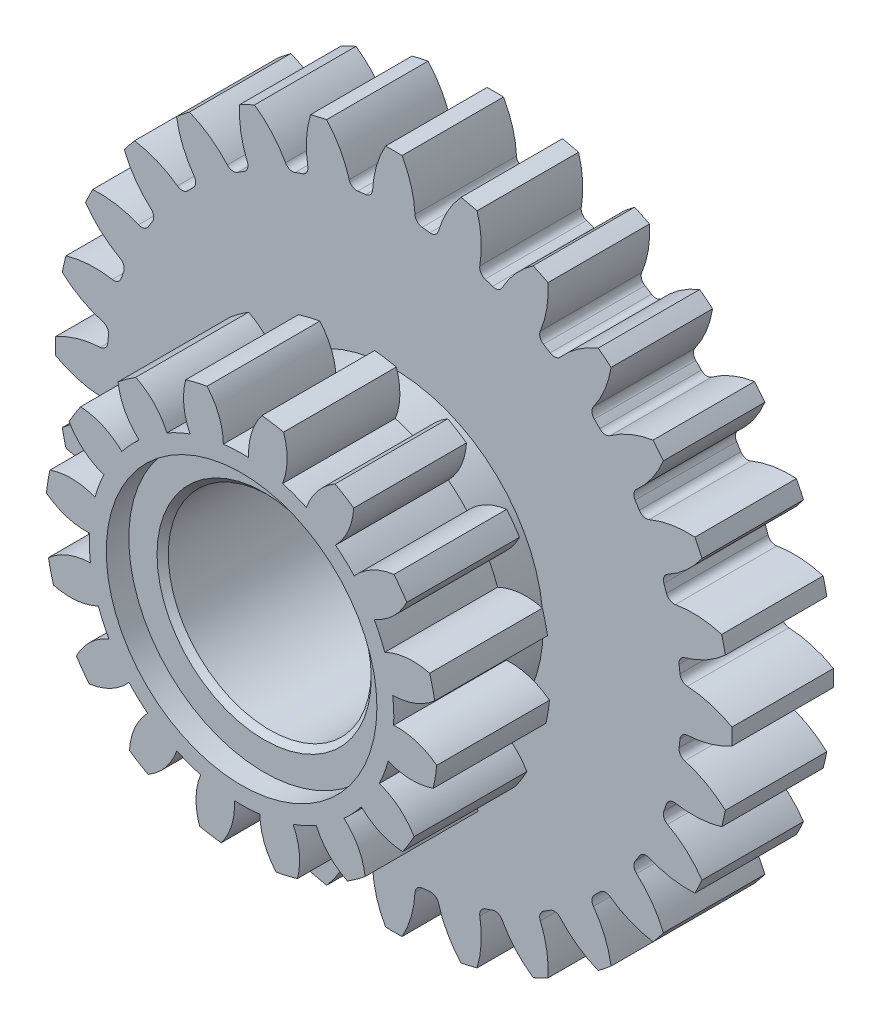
from build123d import *

# Parameters (mm, degrees)
ESQUISSE1_R                        = 5
BASE_EXTRUSION_DEPTH               = 2
BOSS_EXTRU_1_DEPTH                 = 9
CONG_1_R                           = 0.7
R_P_TITION_CIRCULAIRE4_COUNT       = 28
CONG_1_OF_R_P_TITION_CIRCULAIRE4_R = 0.7
ESQUISSE10_R                       = 13.25
BOSS_EXTRU_2_DEPTH                 = 3.5
ENL_V_MAT_EXTRU_2_DEPTH            = 44.829214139
ENL_V_MAT_EXTRU_2_DEPTH_BACK       = 44.829214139
ESQUISSE6_R                        = 9
BOSS_EXTRU_3_DEPTH                 = 10
R_P_TITION_CIRCULAIRE5_COUNT       = 16
ESQUISSE14_R                       = 9
ENL_V_MAT_EXTRU_3_DEPTH            = 45.229515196
ESQUISSE15_R                       = 12
LAMAGE_DEPTH                       = 2
CHANFREIN1_SIZE                    = 0.5
ESQUISSE16_W                       = 7
ESQUISSE16_H                       = 10.5
CHANFREIN2_SIZE                    = 1


with BuildPart() as part:
    # Esquisse1 → Base-Extrusion (new body)
    with BuildSketch(Plane.XY):
        Circle(ESQUISSE1_R)
    extrude(amount=BASE_EXTRUSION_DEPTH)

    # Esquisse3 → Boss.-Extru.1 (add)
    with BuildSketch(Plane.XY.offset(2)):
        with BuildLine():
            Line((-2.855094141, 25.339661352), (0, 0))
            Line((0, 0), (2.855094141, 25.339661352))
            ThreePointArc((2.855094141, 25.339661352), (2.373403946, 25.389307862), (1.890857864, 25.429798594))
            ThreePointArc((1.890857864, 25.429798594), (1.614508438, 27.78765047), (0.730952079, 29.991093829))
            ThreePointArc((0.730952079, 29.991093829), (0, 30), (-0.730952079, 29.991093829))
            ThreePointArc((-0.730952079, 29.991093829), (-1.614508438, 27.78765047), (-1.890857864, 25.429798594))
            ThreePointArc((-1.890857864, 25.429798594), (-2.373403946, 25.389307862), (-2.855094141, 25.339661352))
        make_face()
    boss_extru_1 = extrude(amount=BOSS_EXTRU_1_DEPTH)

    # Cong_1
    cong_1_edges = [part.edges().sort_by_distance(p)[0] for p in [
        (1.890857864, 25.429798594, 6.5),
        (-1.890857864, 25.429798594, 6.5),
    ]]
    fillet(cong_1_edges, radius=CONG_1_R)

    # R_p_tition circulaire4: Boss.-Extru.1 ×28 about axis
    r_p_tition_circulaire4_axis = Axis((0, 0, 0), (0, 0, 1))
    for i in range(1, R_P_TITION_CIRCULAIRE4_COUNT):
        add(boss_extru_1.rotate(r_p_tition_circulaire4_axis, i * 360 / R_P_TITION_CIRCULAIRE4_COUNT))

    # Cong_1 of R_p_tition circulaire4
    cong_1_of_r_p_tition_circulaire4_edges = [part.edges().sort_by_distance(p)[0] for p in [
        (-3.815212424, 25.212975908, 6.5),
        (-7.502112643, 24.371464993, 6.5),
        (-9.32997203, 23.731869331, 6.5),
        (-12.737180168, 22.09104437, 6.5),
        (-14.37688788, 21.060747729, 6.5),
        (-17.333552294, 18.702886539, 6.5),
        (-18.702886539, 17.333552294, 6.5),
        (-21.060747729, 14.37688788, 6.5),
        (-22.09104437, 12.737180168, 6.5),
        (-23.731869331, 9.32997203, 6.5),
        (-24.371464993, 7.502112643, 6.5),
        (-25.212975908, 3.815212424, 6.5),
        (-25.429798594, 1.890857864, 6.5),
        (-25.429798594, -1.890857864, 6.5),
        (-25.212975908, -3.815212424, 6.5),
        (-24.371464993, -7.502112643, 6.5),
        (-23.731869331, -9.32997203, 6.5),
        (-22.09104437, -12.737180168, 6.5),
        (-21.060747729, -14.37688788, 6.5),
        (-18.702886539, -17.333552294, 6.5),
        (-17.333552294, -18.702886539, 6.5),
        (-14.37688788, -21.060747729, 6.5),
        (-12.737180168, -22.09104437, 6.5),
        (-9.32997203, -23.731869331, 6.5),
        (-7.502112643, -24.371464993, 6.5),
        (-3.815212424, -25.212975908, 6.5),
        (-1.890857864, -25.429798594, 6.5),
        (1.890857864, -25.429798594, 6.5),
        (3.815212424, -25.212975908, 6.5),
        (7.502112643, -24.371464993, 6.5),
        (9.32997203, -23.731869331, 6.5),
        (12.737180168, -22.09104437, 6.5),
        (14.37688788, -21.060747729, 6.5),
        (17.333552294, -18.702886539, 6.5),
        (18.702886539, -17.333552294, 6.5),
        (21.060747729, -14.37688788, 6.5),
        (22.09104437, -12.737180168, 6.5),
        (23.731869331, -9.32997203, 6.5),
        (24.371464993, -7.502112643, 6.5),
        (25.212975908, -3.815212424, 6.5),
        (25.429798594, -1.890857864, 6.5),
        (25.429798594, 1.890857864, 6.5),
        (25.212975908, 3.815212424, 6.5),
        (24.371464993, 7.502112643, 6.5),
        (23.731869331, 9.32997203, 6.5),
        (22.09104437, 12.737180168, 6.5),
        (21.060747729, 14.37688788, 6.5),
        (18.702886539, 17.333552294, 6.5),
        (17.333552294, 18.702886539, 6.5),
        (14.37688788, 21.060747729, 6.5),
        (12.737180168, 22.09104437, 6.5),
        (9.32997203, 23.731869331, 6.5),
        (7.502112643, 24.371464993, 6.5),
        (3.815212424, 25.212975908, 6.5),
    ]]
    fillet(cong_1_of_r_p_tition_circulaire4_edges, radius=CONG_1_OF_R_P_TITION_CIRCULAIRE4_R)

    # Esquisse10 → Boss.-Extru.2 (add)
    with BuildSketch(Plane.XY.offset(11)):
        Circle(ESQUISSE10_R)
    extrude(amount=BOSS_EXTRU_2_DEPTH)

    # Esquisse6 → Enl_v. mat.-Extru.2 (cut, two sides: drawn at the far end of the back side and taken through both)
    with BuildSketch(Plane.XY.offset(11).offset(-ENL_V_MAT_EXTRU_2_DEPTH_BACK)):
        Circle(ESQUISSE6_R)
    extrude(amount=ENL_V_MAT_EXTRU_2_DEPTH + ENL_V_MAT_EXTRU_2_DEPTH_BACK, mode=Mode.SUBTRACT)

    # Esquisse11 → Boss.-Extru.3 (add)
    with BuildSketch(Plane.XY.offset(14.5)):
        with BuildLine():
            Line((-5.618719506, 12.275177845), (0, 0))
            Line((0, 0), (-0.49351276, 13.490976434))
            ThreePointArc((-0.49351276, 13.490976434), (-1.056563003, 13.458591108), (-1.617769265, 13.402716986))
            ThreePointArc((-1.617769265, 13.402716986), (-2.005185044, 15.395660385), (-3.063645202, 17.12816622))
            ThreePointArc((-3.063645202, 17.12816622), (-4.016499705, 16.930083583), (-4.956788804, 16.679036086))
            ThreePointArc((-4.956788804, 16.679036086), (-5.124275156, 14.655690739), (-4.575227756, 12.701074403))
            ThreePointArc((-4.575227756, 12.701074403), (-5.101420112, 12.499020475), (-5.618719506, 12.275177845))
        make_face()
    boss_extru_3 = extrude(amount=BOSS_EXTRU_3_DEPTH)

    # R_p_tition circulaire5: Boss.-Extru.3 ×16 about axis
    r_p_tition_circulaire5_axis = Axis((0, 0, 0), (0, 0, 1))
    for i in range(1, R_P_TITION_CIRCULAIRE5_COUNT):
        add(boss_extru_3.rotate(r_p_tition_circulaire5_axis, i * 360 / R_P_TITION_CIRCULAIRE5_COUNT))

    # Esquisse14 → Enl_v. mat.-Extru.3 (cut, through all)
    with BuildSketch(Plane(origin=(0, 0, 14.5), x_dir=(-1, 0, 0), z_dir=(0, 0, -1))):
        with Locations(Location((0, 0, 0), (0, 0, 180))):
            Circle(ESQUISSE14_R)
    extrude(amount=-ENL_V_MAT_EXTRU_3_DEPTH, mode=Mode.SUBTRACT)

    # Esquisse15 → lamage (cut)
    with BuildSketch(Plane.XY.offset(24.5)):
        Circle(ESQUISSE15_R)
    extrude(amount=-LAMAGE_DEPTH, mode=Mode.SUBTRACT)

    # Chanfrein1
    chanfrein1_edges = [part.edges().sort_by_distance(p)[0] for p in [
        (-9, 0, 2),
        (-9, 0, 22.5),
    ]]
    chamfer(chanfrein1_edges, length=CHANFREIN1_SIZE)

    # Esquisse16 → videment (revolve, cut)
    with BuildSketch(Plane(origin=(0, 0, 0), x_dir=(0, 0, -1), z_dir=(1, 0, 0)), mode=Mode.PRIVATE) as videment_sk:
        with Locations((-4.5, 17.25)):
            Rectangle(ESQUISSE16_W, ESQUISSE16_H)
    revolve(videment_sk.sketch.rotate(Axis((0, 0, -7.914042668), (0, 0, 1)), 90), axis=Axis((0, 0, -7.914042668), (0, 0, 1)), mode=Mode.SUBTRACT)

    # Chanfrein2
    chanfrein2_edges = [part.edges().sort_by_distance(p)[0] for p in [
        (22.5, 0, 8),
        (12, 0, 8),
    ]]
    chamfer(chanfrein2_edges, length=CHANFREIN2_SIZE)


solid = part.part
